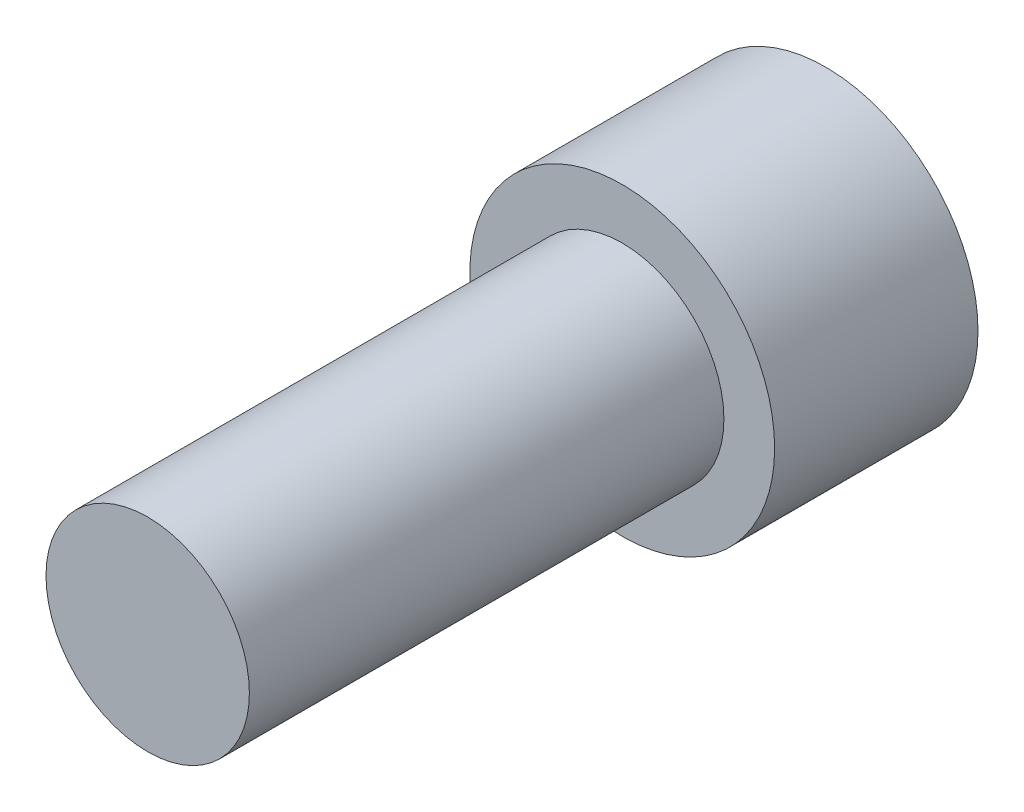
from build123d import *

# Parameters (mm, degrees)
HEX_2_DEPTH = 5.842


with BuildPart() as part:
    # Sketch6 → Revolve1 (revolve)
    with BuildSketch(Plane(origin=(0, 0, 0), x_dir=(0, 0, -1), z_dir=(1, 0, 0)), mode=Mode.PRIVATE) as revolve1_sk:
        Polygon((-22.225, 0), (-22.225, -4.7625), (0, -4.7625), (0, -7.1374), (9.525, -7.1374), (9.525, 0), align=None)
    revolve(revolve1_sk.sketch.rotate(Axis((0, 0, 22.225), (0, 0, -1)), 270), axis=Axis((0, 0, 22.225), (0, 0, -1)))

    # Sketch7 → HEX 2 (cut)
    with BuildSketch(Plane(origin=(0, 0, -9.525), x_dir=(-1, 0, 0), z_dir=(0, 0, -1))):
        Polygon((-3.9624, 2.287692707), (-3.9624, -2.287692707), (0, -4.575385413), (3.9624, -2.287692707), (3.9624, 2.287692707), (0, 4.575385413), align=None)
    extrude(amount=-HEX_2_DEPTH, mode=Mode.SUBTRACT)


solid = part.part
